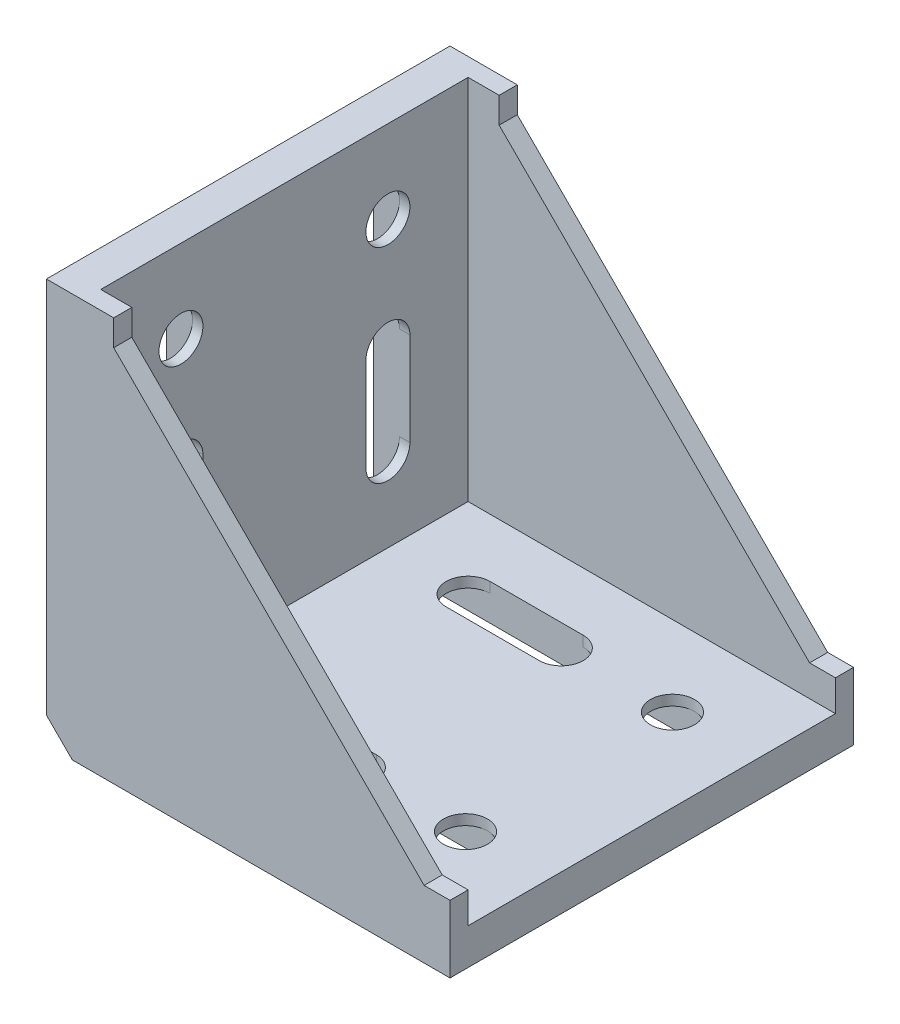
from build123d import *

# Parameters (mm, degrees)
EXTRUDE_1_DEPTH     = 39
EXTRUDE_2_DEPTH     = 3.5
SKETCH_3_R          = 4.25
CUT_EXTRUDE_1_DEPTH = 118
SKETCH_4_W          = 66.5
SKETCH_4_H          = 8
CUT_EXTRUDE_2_DEPTH = 5
EXTRUDE_3_DEPTH     = 2
SKETCH_6_W          = 64.859616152
SKETCH_6_H          = 24
CUT_EXTRUDE_3_DEPTH = 5
CHAMFER_1_SIZE      = 5


with BuildPart() as part:
    # Sketch 1 → Extrude 1 (new, symmetric)
    with BuildSketch(Plane.XY):
        Polygon((0, 78), (7, 78), (7, 7), (78, 7), (78, 0), (0, 0), align=None)
    extrude(amount=EXTRUDE_1_DEPTH, both=True)

    # Sketch 2 → Extrude 2 (add)
    with BuildSketch(Plane.XY.offset(39)):
        Polygon((7, 78), (13, 78), (13, 73), (73, 13), (78, 13), (78, 7), (7, 7), align=None)
    extrude_2 = extrude(amount=-EXTRUDE_2_DEPTH)

    # Mirror 1: Extrude 2 across plane
    add(extrude_2.mirror(Plane.XY))

    # Sketch 3 → Cut-Extrude 1 (cut, through all)
    with BuildSketch(Plane.XZ):
        with Locations((62, 20)):
            Circle(SKETCH_3_R)
        with Locations((62, -20)):
            Circle(SKETCH_3_R)
        with BuildLine():
            Line((40.5, 15.75), (22.5, 15.75))
            ThreePointArc((22.5, 15.75), (18.25, 20), (22.5, 24.25))
            Line((22.5, 24.25), (40.5, 24.25))
            ThreePointArc((40.5, 24.25), (44.75, 20), (40.5, 15.75))
        make_face()
        with BuildLine():
            Line((40.5, -15.75), (22.5, -15.75))
            ThreePointArc((22.5, -15.75), (18.25, -20), (22.5, -24.25))
            Line((22.5, -24.25), (40.5, -24.25))
            ThreePointArc((40.5, -24.25), (44.75, -20), (40.5, -15.75))
        make_face()
    cut_extrude_1 = extrude(amount=-CUT_EXTRUDE_1_DEPTH, mode=Mode.SUBTRACT)

    # Sketch 4 → Cut-Extrude 2 (cut)
    with BuildSketch(Plane.XZ):
        with Locations((39.75, 31.5)):
            Rectangle(SKETCH_4_W, SKETCH_4_H)
        Polygon((62, 24.25), (70, 24.25), (70, 15.75), (10, 15.75), (10, 24.25), align=None)
        Polygon((10, -24.25), (62, -24.25), (70, -24.25), (70, -15.75), (10, -15.75), align=None)
        with Locations((39.75, -31.5)):
            Rectangle(SKETCH_4_W, SKETCH_4_H)
    cut_extrude_2 = extrude(amount=-CUT_EXTRUDE_2_DEPTH, mode=Mode.SUBTRACT)

    # Sketch 5 → Extrude 3 (add)
    with BuildSketch(Plane.XZ):
        Polygon((70, 20), (70, 16.1), (72, 16.1), (72, 23.9), (70, 23.9), align=None)
        Polygon((10, 23.9), (8, 23.9), (8, 16.05), (10, 16.05), (10, 20), align=None)
        Polygon((10, -20), (10, -23.9), (8, -23.9), (8, -16.05), (10, -16.05), align=None)
        Polygon((70, -23.9), (70, -20), (70, -16.1), (72, -16.1), (72, -23.9), align=None)
    extrude_3 = extrude(amount=EXTRUDE_3_DEPTH)

    # Sketch 6 → Cut-Extrude 3 (cut)
    with BuildSketch(Plane.XZ):
        with Locations((39.880994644, 0)):
            Rectangle(SKETCH_6_W, SKETCH_6_H)
    cut_extrude_3 = extrude(amount=-CUT_EXTRUDE_3_DEPTH, mode=Mode.SUBTRACT)

    # Mirror 2: Cut-Extrude 1 across plane
    add(cut_extrude_1.mirror(Plane(origin=(0, 0, 0), x_dir=(0, 0, 1), z_dir=(-0.7071067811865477, 0.7071067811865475, 0))), mode=Mode.SUBTRACT)

    # Mirror 3: Cut-Extrude 2 across plane
    add(cut_extrude_2.mirror(Plane(origin=(0, 0, 0), x_dir=(0, 0, 1), z_dir=(-0.7071067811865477, 0.7071067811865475, 0))), mode=Mode.SUBTRACT)

    # Mirror 4: Cut-Extrude 3 across plane
    add(cut_extrude_3.mirror(Plane(origin=(0, 0, 0), x_dir=(0, 0, 1), z_dir=(-0.7071067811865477, 0.7071067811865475, 0))), mode=Mode.SUBTRACT)

    # Mirror 5: Extrude 3 across plane
    add(extrude_3.mirror(Plane(origin=(0, 0, 0), x_dir=(0, 0, 1), z_dir=(-0.7071067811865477, 0.7071067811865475, 0))))

    # Chamfer 1
    chamfer_1_edges = [part.edges().sort_by_distance(p)[0] for p in [
        (0, 0, 0),
    ]]
    chamfer(chamfer_1_edges, length=CHAMFER_1_SIZE)


solid = part.part
